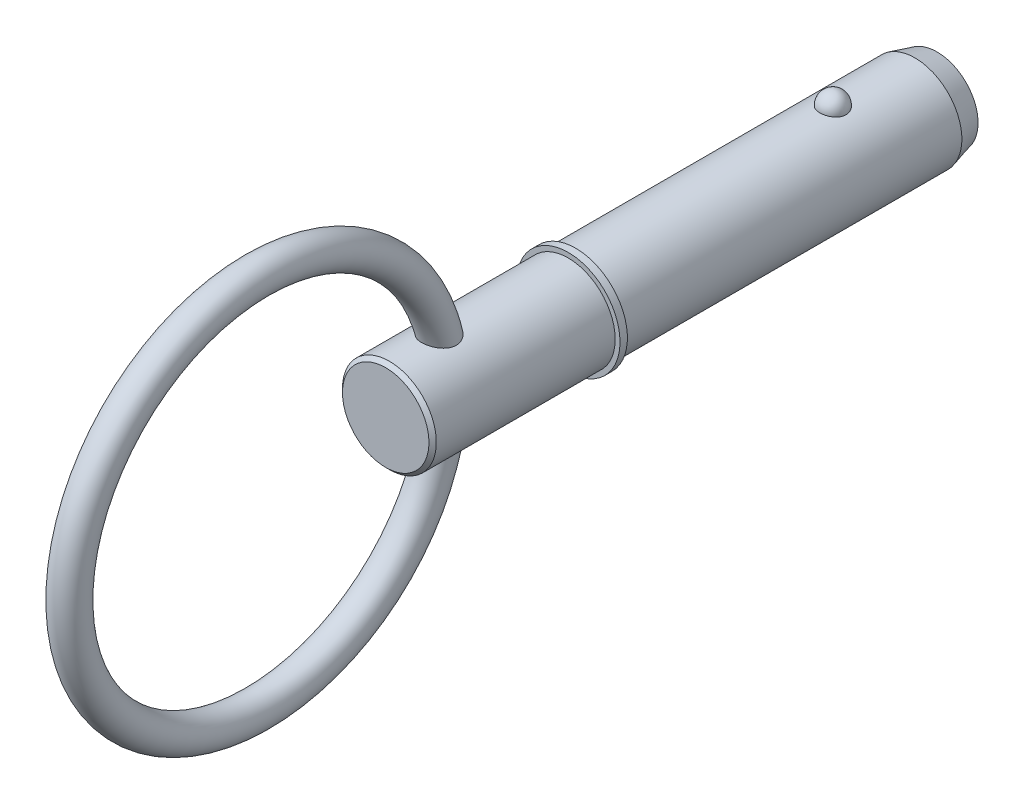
from build123d import *

# Parameters (mm, degrees)
SKETCH2_R           = 6.35
BOSS_EXTRUDE1_DEPTH = 33.02
BOSS_EXTRUDE2_START = 15.88
SKETCH3_R           = 6.35
BOSS_EXTRUDE2_DEPTH = 15.88
CHAMFER1_SIZE       = 3
CHAMFER1_SIZE2      = 0.803847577
SKETCH20_W          = 1
SKETCH20_H          = 7
SKETCH21_R          = 6.35
BOSS_EXTRUDE3_DEPTH = 25.7
CHAMFER2_SIZE       = 0.5
SKETCH24_R          = 2.25


with BuildPart() as part:
    # Sketch2 → Boss-Extrude1 (new body)
    with BuildSketch(Plane.XY):
        Circle(SKETCH2_R)
    extrude(amount=BOSS_EXTRUDE1_DEPTH)

    # Sketch3 → Boss-Extrude2 (add)
    with BuildSketch(Plane(origin=(0, 0, 0), x_dir=(-1, 0, 0), z_dir=(0, 0, -1)).offset(BOSS_EXTRUDE2_START)):
        Circle(SKETCH3_R)
    extrude(amount=-BOSS_EXTRUDE2_DEPTH)

    # Chamfer1
    chamfer1_edges = [part.edges().sort_by_distance(p)[0] for p in [
        (6.35, 0, -15.88),
    ]]
    chamfer1_side = [part.faces().sort_by_distance(p)[0] for p in [
        (6.35, 0, -7.94),
    ]]
    chamfer(chamfer1_edges, length=CHAMFER1_SIZE, length2=CHAMFER1_SIZE2, reference=chamfer1_side[0])

    # Sketch18 → Revolve1 (revolve)
    with BuildSketch(Plane(origin=(0, 0, 0), x_dir=(0, 0, -1), z_dir=(1, 0, 0))):
        with BuildLine():
            Line((1.78, 8.13), (1.78, 4.57))
            ThreePointArc((1.78, 4.57), (0, 6.35), (1.78, 8.13))
        make_face()
    revolve(axis=Axis((0, 8.13, -1.78), (0, -1, 0)))

    # Sketch20 → Revolve2 (revolve)
    with BuildSketch(Plane(origin=(0, 0, 0), x_dir=(0, 0, -1), z_dir=(1, 0, 0)), mode=Mode.PRIVATE) as revolve2_sk:
        with Locations((-33.52, 3.5)):
            Rectangle(SKETCH20_W, SKETCH20_H)
    revolve(revolve2_sk.sketch.rotate(Axis((0, 0, 33.728787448), (0, 0, 1)), 90), axis=Axis((0, 0, 33.728787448), (0, 0, 1)))

    # Sketch21 → Boss-Extrude3 (add)
    with BuildSketch(Plane(origin=(0, 0, 33.02), x_dir=(-1, 0, 0), z_dir=(0, 0, -1))):
        Circle(SKETCH21_R)
    extrude(amount=-BOSS_EXTRUDE3_DEPTH)

    # Chamfer2
    chamfer2_edges = [part.edges().sort_by_distance(p)[0] for p in [
        (6.35, 0, 58.72),
    ]]
    chamfer(chamfer2_edges, length=CHAMFER2_SIZE)

    # Sweep1: sweep along a path in Sketch23
    with BuildLine(Plane(origin=(0, 0, 0), x_dir=(0, 0, -1), z_dir=(1, 0, 0))) as sweep1_path:
        CenterArc((-76.12, 0), 25.4, 0, 360)
    # Sketch24 → Sweep1 (sweep)
    with BuildSketch(Plane(origin=(0, 0, 0), x_dir=(1, 0, 0), z_dir=(0, 1, 0))):
        with Locations((0, -50.72)):
            Circle(SKETCH24_R)
    sweep(path=sweep1_path.line)


solid = part.part
